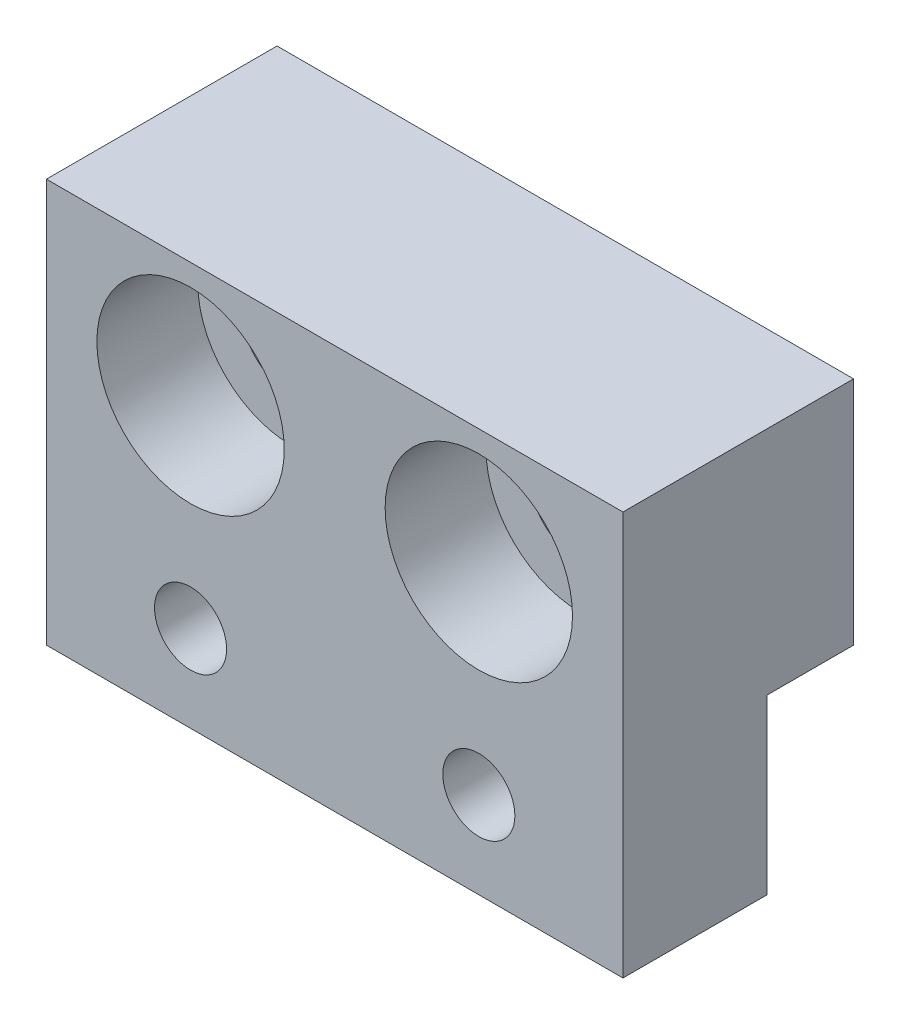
from build123d import *

# Parameters (mm, degrees)
SKETCH_1_W          = 20
SKETCH_1_H          = 14
SKETCH_1_R          = 1.75
SKETCH_1_R_2        = 1.25
EXTRUDE_1_DEPTH     = 8
SKETCH_2_R          = 3.25
CUT_EXTRUDE_1_DEPTH = 3.5
SKETCH_4_OUTSIDE_W  = 15.138
SKETCH_4_OUTSIDE_H  = 21.138
CUT_EXTRUDE_2_DEPTH = 26.690465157


with BuildPart() as part:
    # Sketch 1 → Extrude 1 (new body)
    with BuildSketch(Plane.XY):
        with Locations((10, 7)):
            Rectangle(SKETCH_1_W, SKETCH_1_H)
        with Locations((15, 10)):
            Circle(SKETCH_1_R, mode=Mode.SUBTRACT)
        with Locations((5, 10)):
            Circle(SKETCH_1_R, mode=Mode.SUBTRACT)
        with Locations((5, 3)):
            Circle(SKETCH_1_R_2, mode=Mode.SUBTRACT)
        with Locations((15, 3)):
            Circle(SKETCH_1_R_2, mode=Mode.SUBTRACT)
    extrude(amount=EXTRUDE_1_DEPTH)

    # Sketch 2 → Cut-Extrude 1 (cut)
    with BuildSketch(Plane.XY.offset(8)):
        with Locations((15, 10)):
            Circle(SKETCH_2_R)
        with Locations((5, 10)):
            Circle(SKETCH_2_R)
    extrude(amount=-CUT_EXTRUDE_1_DEPTH, mode=Mode.SUBTRACT)

    # Sketch 4 outside → Cut-Extrude 2 (cut, through all)
    with BuildSketch(Plane(origin=(20, 0, 0), x_dir=(0, 0, -1), z_dir=(1, 0, 0))):
        with Locations((-4, 7)):
            Rectangle(SKETCH_4_OUTSIDE_W, SKETCH_4_OUTSIDE_H)
        Polygon((-8, 14), (0, 14), (0, 6), (-3, 6), (-3, 0), (-8, 0), align=None, mode=Mode.SUBTRACT)
    extrude(amount=-CUT_EXTRUDE_2_DEPTH, mode=Mode.SUBTRACT)


solid = part.part
